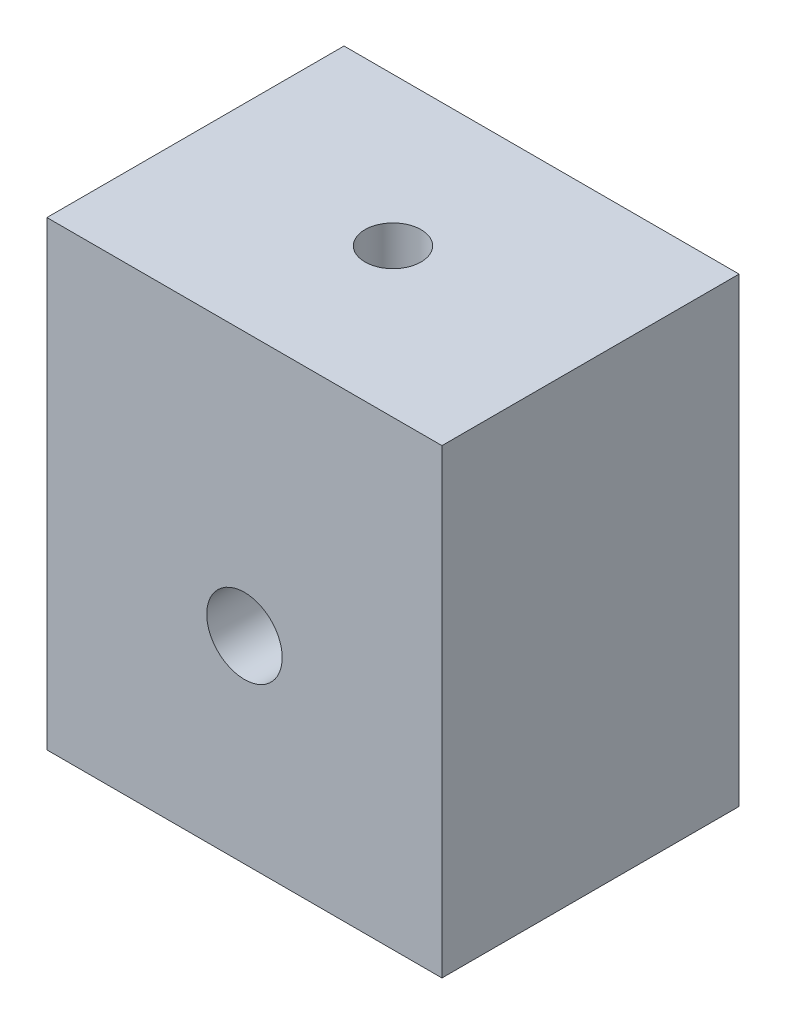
from build123d import *

# Parameters (mm, degrees)
SKETCH1_W           = 35.9
SKETCH1_H           = 35.9
SKETCH1_W_2         = 25.9
SKETCH1_H_2         = 25.9
BOSS_EXTRUDE1_DEPTH = 20
SKETCH2_W           = 35.9
SKETCH2_H           = 35.9
BOSS_EXTRUDE2_DEPTH = 7
SKETCH3_R           = 3.43
CUT_EXTRUDE1_DEPTH  = 10
SKETCH10_R          = 2.54
CUT_EXTRUDE3_DEPTH  = 10
SKETCH11_W          = 35.9
SKETCH11_H          = 27
BOSS_EXTRUDE3_DEPTH = 6
SKETCH12_R          = 2.55
CUT_EXTRUDE4_DEPTH  = 8


with BuildPart() as part:
    # Sketch1 → Boss-Extrude1 (new body)
    with BuildSketch(Plane.XY):
        Rectangle(SKETCH1_W, SKETCH1_H)
        Rectangle(SKETCH1_W_2, SKETCH1_H_2, mode=Mode.SUBTRACT)
    extrude(amount=-BOSS_EXTRUDE1_DEPTH)

    # Sketch2 → Boss-Extrude2 (add)
    with BuildSketch(Plane.XY):
        Rectangle(SKETCH2_W, SKETCH2_H)
    extrude(amount=BOSS_EXTRUDE2_DEPTH)

    # Sketch3 → Cut-Extrude1 (cut)
    with BuildSketch(Plane.XY.offset(7)):
        Circle(SKETCH3_R)
    extrude(amount=-CUT_EXTRUDE1_DEPTH, mode=Mode.SUBTRACT)

    # Sketch10 → Cut-Extrude3 (cut)
    with BuildSketch(Plane(origin=(0, 17.95, 0), x_dir=(1, 0, 0), z_dir=(0, 1, 0))):
        with Locations(Location((0, 6.5, 0), (0, 0, 270))):
            Circle(SKETCH10_R)
    extrude(amount=-CUT_EXTRUDE3_DEPTH, mode=Mode.SUBTRACT)

    # Sketch11 → Boss-Extrude3 (add)
    with BuildSketch(Plane(origin=(0, 17.95, 0), x_dir=(1, 0, 0), z_dir=(0, 1, 0))):
        with Locations((0, 6.5)):
            Rectangle(SKETCH11_W, SKETCH11_H)
    extrude(amount=BOSS_EXTRUDE3_DEPTH)

    # Sketch12 → Cut-Extrude4 (cut)
    with BuildSketch(Plane(origin=(0, 23.95, 0), x_dir=(1, 0, 0), z_dir=(0, 1, 0))):
        with Locations(Location((0, 6.5, 0), (0, 0, 270))):
            Circle(SKETCH12_R)
    extrude(amount=-CUT_EXTRUDE4_DEPTH, mode=Mode.SUBTRACT)


solid = part.part
